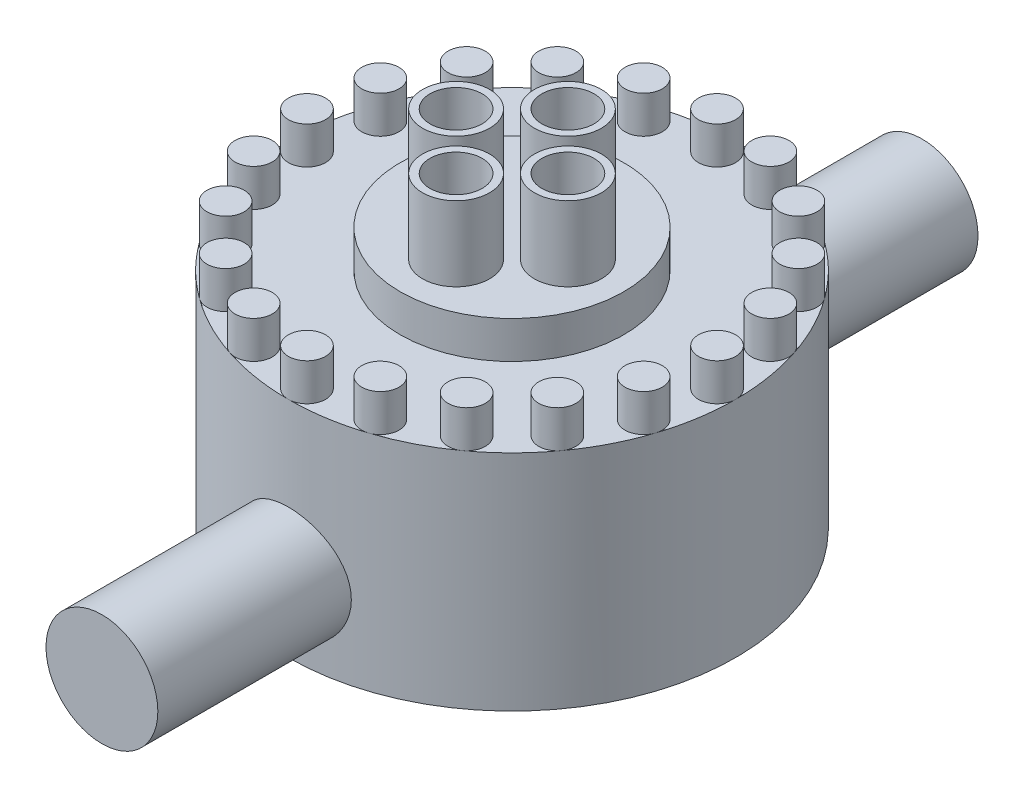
from build123d import *

# Parameters (mm, degrees)
SKETCH1_R           = 300
BOSS_EXTRUDE1_DEPTH = 300
SKETCH2_R           = 25
BOSS_EXTRUDE2_DEPTH = 50
SKETCH3_R           = 150
BOSS_EXTRUDE3_DEPTH = 50
SKETCH4_R           = 35
CUT_EXTRUDE2_DEPTH  = 551
BOSS_EXTRUDE5_START = 100
SKETCH5_R           = 45
SKETCH5_R_2         = 35
BOSS_EXTRUDE5_DEPTH = 100
SKETCH7_R           = 75
BOSS_EXTRUDE6_DEPTH = 400
SKETCH8_R           = 75
BOSS_EXTRUDE7_DEPTH = 400


with BuildPart() as part:
    # Sketch1 → Boss-Extrude1 (new body)
    with BuildSketch(Plane(origin=(0, 0, 0), x_dir=(1, 0, 0), z_dir=(0, 1, 0))):
        with Locations(Location((0, 0, 0), (0, 0, 270))):
            Circle(SKETCH1_R)
    extrude(amount=BOSS_EXTRUDE1_DEPTH)

    # Sketch2 → Boss-Extrude2 (add)
    with BuildSketch(Plane(origin=(0, 300, 0), x_dir=(1, 0, 0), z_dir=(0, 1, 0))):
        with Locations(Location((-84.979673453, 261.540541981, 0), (0, 0, 107.999837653))):
            Circle(SKETCH2_R)
        with Locations(Location((-161.64094438, 222.479673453, 0), (0, 0, 125.999841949))):
            Circle(SKETCH2_R)
        with Locations(Location((-222.479673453, 161.64094438, 0), (0, 0, 143.999838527))):
            Circle(SKETCH2_R)
        with Locations(Location((-261.540541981, 84.979673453, 0), (0, 0, 161.999828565))):
            Circle(SKETCH2_R)
        with Locations(Location((-275, 0, 0), (0, 0, 179.999814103))):
            Circle(SKETCH2_R)
        with Locations(Location((-261.540541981, -84.979673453, 0), (0, 0, 197.999797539))):
            Circle(SKETCH2_R)
        with Locations(Location((-222.479673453, -161.64094438, 0), (0, 0, 215.999779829))):
            Circle(SKETCH2_R)
        with Locations(Location((-161.64094438, -222.479673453, 0), (0, 0, 233.999763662))):
            Circle(SKETCH2_R)
        with Locations(Location((-84.979673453, -261.540541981, 0), (0, 0, 251.999750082))):
            Circle(SKETCH2_R)
        with Locations(Location((0, -275, 0), (0, 0, 269.999739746))):
            Circle(SKETCH2_R)
        with Locations(Location((84.979673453, -261.540541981, 0), (0, 0, 287.999733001))):
            Circle(SKETCH2_R)
        with Locations(Location((161.640944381, -222.479673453, 0), (0, 0, 305.999731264))):
            Circle(SKETCH2_R)
        with Locations(Location((222.479673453, -161.64094438, 0), (0, 0, 323.999733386))):
            Circle(SKETCH2_R)
        with Locations(Location((261.540541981, -84.979673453, 0), (0, 0, 341.999739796))):
            Circle(SKETCH2_R)
        with Locations(Location((275, 0, 0), (0, 0, 359.999750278))):
            Circle(SKETCH2_R)
        with Locations(Location((261.540541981, 84.979673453, 0), (0, 0, 17.999763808))):
            Circle(SKETCH2_R)
        with Locations(Location((222.479673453, 161.64094438, 0), (0, 0, 35.999779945))):
            Circle(SKETCH2_R)
        with Locations(Location((161.64094438, 222.479673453, 0), (0, 0, 53.999797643))):
            Circle(SKETCH2_R)
        with Locations(Location((84.979673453, 261.540541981, 0), (0, 0, 71.999815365))):
            Circle(SKETCH2_R)
        with Locations(Location((0, 275, 0), (0, 0, 89.999830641))):
            Circle(SKETCH2_R)
    extrude(amount=BOSS_EXTRUDE2_DEPTH)

    # Sketch3 → Boss-Extrude3 (add)
    with BuildSketch(Plane(origin=(0, 300, 0), x_dir=(1, 0, 0), z_dir=(0, 1, 0))):
        with Locations(Location((0, 0, 0), (0, 0, 270))):
            Circle(SKETCH3_R)
    extrude(amount=BOSS_EXTRUDE3_DEPTH)

    # Sketch4 → Cut-Extrude2 (cut, through all)
    with BuildSketch(Plane(origin=(0, 350, 0), x_dir=(1, 0, 0), z_dir=(0, 1, 0))):
        with Locations(Location((0, 75, 0), (0, 0, 270))):
            Circle(SKETCH4_R)
        with Locations(Location((75, 0, 0), (0, 0, 270))):
            Circle(SKETCH4_R)
        with Locations(Location((0, -75, 0), (0, 0, 270))):
            Circle(SKETCH4_R)
        with Locations(Location((-75, 0, 0), (0, 0, 270))):
            Circle(SKETCH4_R)
    extrude(amount=-CUT_EXTRUDE2_DEPTH, mode=Mode.SUBTRACT)

    # Sketch5 → Boss-Extrude5 (add)
    # profile 1 of 4: a face of its own
    with BuildSketch(Plane(origin=(0, 350, 0), x_dir=(1, 0, 0), z_dir=(0, 1, 0)).offset(BOSS_EXTRUDE5_START)):
        with Locations(Location((0, 75, 0), (0, 0, 270))):
            Circle(SKETCH5_R)
        with Locations(Location((0, 75, 0), (0, 0, 270))):
            Circle(SKETCH5_R_2, mode=Mode.SUBTRACT)
    # profile 2 of 4: a face of its own
    with BuildSketch(Plane(origin=(0, 350, 0), x_dir=(1, 0, 0), z_dir=(0, 1, 0)).offset(BOSS_EXTRUDE5_START)):
        with Locations(Location((75, 0, 0), (0, 0, 270))):
            Circle(SKETCH5_R)
        with Locations(Location((75, 0, 0), (0, 0, 270))):
            Circle(SKETCH5_R_2, mode=Mode.SUBTRACT)
    # profile 3 of 4: a face of its own
    with BuildSketch(Plane(origin=(0, 350, 0), x_dir=(1, 0, 0), z_dir=(0, 1, 0)).offset(BOSS_EXTRUDE5_START)):
        with Locations(Location((0, -75, 0), (0, 0, 270))):
            Circle(SKETCH5_R)
        with Locations(Location((0, -75, 0), (0, 0, 270))):
            Circle(SKETCH5_R_2, mode=Mode.SUBTRACT)
    # profile 4 of 4: a face of its own
    with BuildSketch(Plane(origin=(0, 350, 0), x_dir=(1, 0, 0), z_dir=(0, 1, 0)).offset(BOSS_EXTRUDE5_START)):
        with Locations(Location((-75, 0, 0), (0, 0, 270))):
            Circle(SKETCH5_R)
        with Locations(Location((-75, 0, 0), (0, 0, 270))):
            Circle(SKETCH5_R_2, mode=Mode.SUBTRACT)
    extrude(amount=-BOSS_EXTRUDE5_DEPTH)

    # Sketch7 → Boss-Extrude6 (add)
    with BuildSketch(Plane.XY.offset(150)):
        with Locations(Location((0, 100, 0), (0, 0, 180))):
            Circle(SKETCH7_R)
    extrude(amount=BOSS_EXTRUDE6_DEPTH)

    # Sketch8 → Boss-Extrude7 (add)
    with BuildSketch(Plane.XY.offset(-150)):
        with Locations((0, 102.505159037)):
            Circle(SKETCH8_R)
    extrude(amount=-BOSS_EXTRUDE7_DEPTH)


solid = part.part
